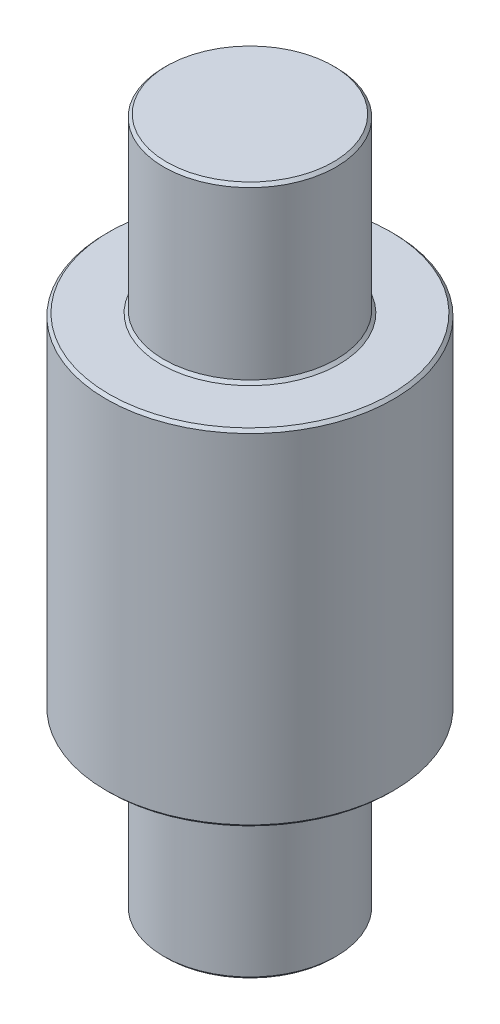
from build123d import *

# Parameters (mm, degrees)
CHAMFER_1_SIZE = 0.5


with BuildPart() as part:
    # Sketch 1 → Revolve 1 (revolve)
    with BuildSketch(Plane.XY, mode=Mode.PRIVATE) as revolve_1_sk:
        Polygon((0, 60), (0, -60), (-15, -60), (-15, -30), (-25, -30), (-25, 30), (-15, 30), (-15, 60), align=None)
    revolve(revolve_1_sk.sketch.rotate(Axis((0, 60, 0), (0, -1, 0)), 270), axis=Axis((0, 60, 0), (0, -1, 0)))

    # Chamfer 1
    chamfer_1_edges = [part.edges().sort_by_distance(p)[0] for p in [
        (0, -60, -15),
        (0, -30, -15),
        (0, -30, -25),
        (0, 30, -25),
        (0, 30, -15),
        (0, 60, -15),
    ]]
    chamfer(chamfer_1_edges, length=CHAMFER_1_SIZE)


solid = part.part
